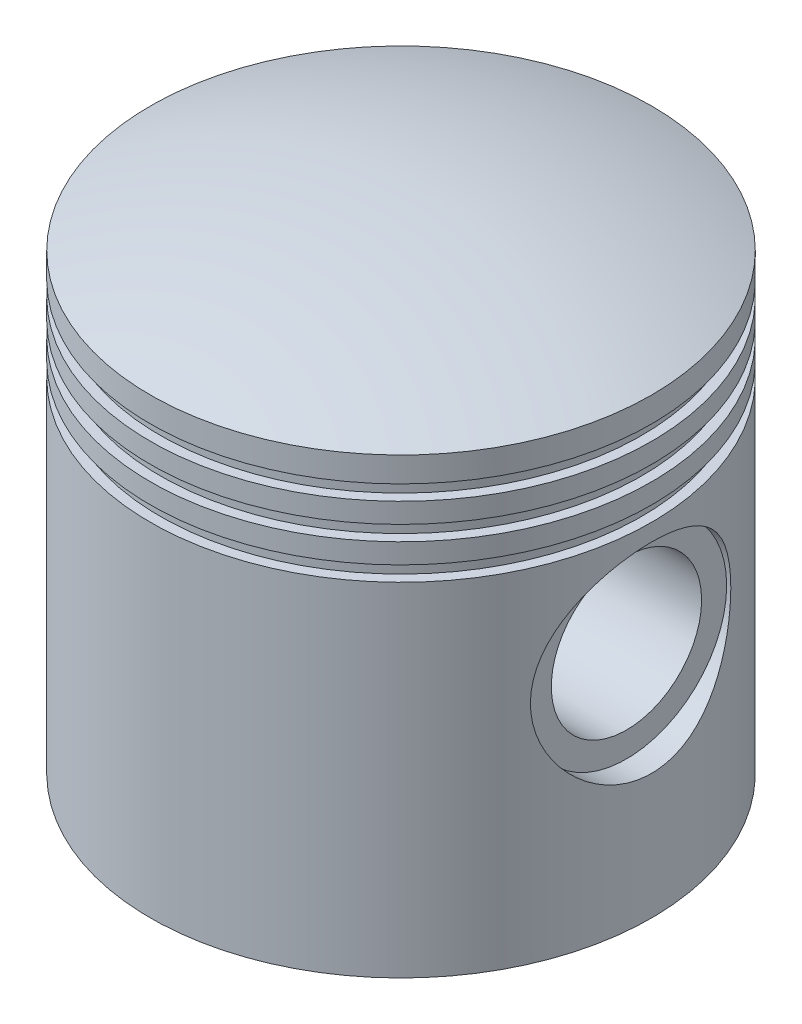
from build123d import *

# Parameters (mm, degrees)
CUT_EXTRUDE1_DEPTH       = 123.474487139
CUT_EXTRUDE1_DEPTH_BACK  = 123.474487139
SKETCH2_R                = 15
BOSS_EXTRUDE1_REACH      = 133.909
BOSS_EXTRUDE1_END_RADIUS = 37.5
SKETCH3_R                = 20
SKETCH3_R_2              = 15
SKETCH4_R                = 20
SKETCH4_R_2              = 15
CUT_EXTRUDE2_DEPTH       = 5


with BuildPart() as part:
    # Sketch1 → Revolve1 (revolve)
    with BuildSketch(Plane.XY, mode=Mode.PRIVATE) as revolve1_sk:
        with BuildLine():
            Line((0, 84), (37.5, 84))
            Line((37.5, 84), (37.5, 20))
            Line((37.5, 20), (43, 20))
            Line((43, 20), (43, 0))
            Line((43, 0), (50, 0))
            Line((50, 0), (50, 68.39936204))
            Line((50, 68.39936204), (48, 68.39936204))
            Line((48, 68.39936204), (48, 71.39936204))
            Line((48, 71.39936204), (50, 71.39936204))
            Line((50, 71.39936204), (50, 75.39936204))
            Line((50, 75.39936204), (48, 75.39936204))
            Line((48, 75.39936204), (48, 78.39936204))
            Line((48, 78.39936204), (50, 78.39936204))
            Line((50, 78.39936204), (50, 82.39936204))
            Line((50, 82.39936204), (48, 82.39936204))
            Line((48, 82.39936204), (48, 85.39936204))
            Line((48, 85.39936204), (50, 85.39936204))
            Line((50, 85.39936204), (50, 90.39936204))
            ThreePointArc((50, 90.39936204), (25.456689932, 97.57811636), (0, 100))
            Line((0, 100), (0, 84))
        make_face()
    revolve(revolve1_sk.sketch.rotate(Axis((0, 0, 0), (0, 1, 0)), 90), axis=Axis((0, 0, 0), (0, 1, 0)))

    # Sketch2 → Cut-Extrude1 (cut, two sides: drawn at the far end of the back side and taken through both)
    with BuildSketch(Plane(origin=(0, 0, 0), x_dir=(0, 0, -1), z_dir=(1, 0, 0)).offset(-CUT_EXTRUDE1_DEPTH_BACK)):
        with Locations((0, 45)):
            Circle(SKETCH2_R)
    extrude(amount=CUT_EXTRUDE1_DEPTH + CUT_EXTRUDE1_DEPTH_BACK, mode=Mode.SUBTRACT)

    # Boss-Extrude1: up to this cylinder (the profile starts inside it)
    boss_extrude1_end = Plane(origin=(0, 45, 0), z_dir=(0, -1, 0)) * Cylinder(BOSS_EXTRUDE1_END_RADIUS, 343.818, mode=Mode.PRIVATE)
    # Sketch3 → Boss-Extrude1 (add, up to the surface)
    with BuildSketch(Plane(origin=(20, 0, 0), x_dir=(0, 0, -1), z_dir=(1, 0, 0)), mode=Mode.PRIVATE) as boss_extrude1_sk1:
        with Locations(Location((0, 45, 0), (0, 0, 180))):
            Circle(SKETCH3_R)
        with Locations((0, 45)):
            Circle(SKETCH3_R_2, mode=Mode.SUBTRACT)
    boss_extrude1_tool1 = extrude(boss_extrude1_sk1.sketch, amount=BOSS_EXTRUDE1_REACH, mode=Mode.PRIVATE) & boss_extrude1_end
    boss_extrude1 = boss_extrude1_tool1.solids().sort_by_distance((20, 45, -19.434315))[0]
    add(boss_extrude1)

    # Mirror1: Boss-Extrude1 across plane
    add(boss_extrude1.mirror(Plane(origin=(0, 0, 0), x_dir=(0, 0, 1), z_dir=(1, 0, 0))))

    # Sketch4 → Cut-Extrude2 (cut)
    with BuildSketch(Plane(origin=(50, 0, 0), x_dir=(0, 0, -1), z_dir=(1, 0, 0))):
        with Locations(Location((0, 45, 0), (0, 0, 180))):
            Circle(SKETCH4_R)
        with Locations((0, 45)):
            Circle(SKETCH4_R_2, mode=Mode.SUBTRACT)
    cut_extrude2 = extrude(amount=-CUT_EXTRUDE2_DEPTH, mode=Mode.SUBTRACT)

    # Mirror2: Cut-Extrude2 across plane
    add(cut_extrude2.mirror(Plane(origin=(0, 0, 0), x_dir=(0, 0, 1), z_dir=(1, 0, 0))), mode=Mode.SUBTRACT)


solid = part.part
